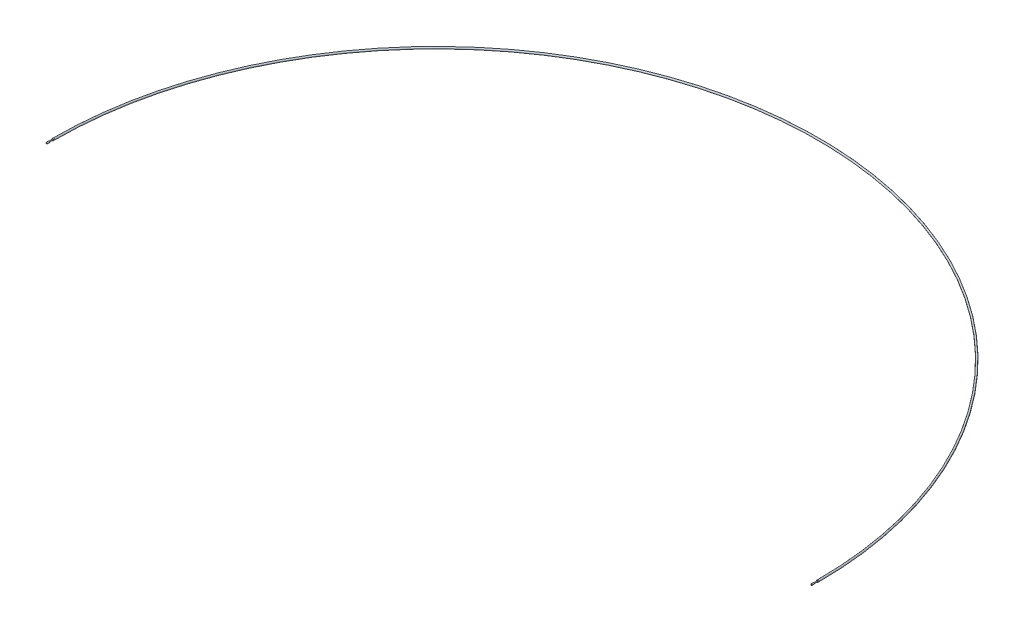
ISO-10303-21;
HEADER;
FILE_DESCRIPTION(('STEP AP214'),'2;1');
FILE_NAME('part.step','',(''),(''),'','','');
FILE_SCHEMA(('AUTOMOTIVE_DESIGN { 1 0 10303 214 1 1 1 1 }'));
ENDSEC;
DATA;
#1=APPLICATION_CONTEXT('core data for automotive mechanical design processes');
#2=APPLICATION_PROTOCOL_DEFINITION('international standard','automotive_design',2000,#1);
#3=PRODUCT_CONTEXT('',#1,'mechanical');
#4=PRODUCT('Part','Part','',(#3));
#5=PRODUCT_RELATED_PRODUCT_CATEGORY('part','',(#4));
#6=PRODUCT_DEFINITION_FORMATION('','',#4);
#7=PRODUCT_DEFINITION_CONTEXT('part definition',#1,'design');
#8=PRODUCT_DEFINITION('design','',#6,#7);
#9=PRODUCT_DEFINITION_SHAPE('','',#8);
#10=(LENGTH_UNIT() NAMED_UNIT(*) SI_UNIT(.MILLI.,.METRE.));
#11=(NAMED_UNIT(*) PLANE_ANGLE_UNIT() SI_UNIT($,.RADIAN.));
#12=(NAMED_UNIT(*) SI_UNIT($,.STERADIAN.) SOLID_ANGLE_UNIT());
#13=UNCERTAINTY_MEASURE_WITH_UNIT(LENGTH_MEASURE(1.E-05),#10,'distance_accuracy_value','');
#14=(GEOMETRIC_REPRESENTATION_CONTEXT(3) GLOBAL_UNCERTAINTY_ASSIGNED_CONTEXT((#13)) GLOBAL_UNIT_ASSIGNED_CONTEXT((#10,
#11,#12)) REPRESENTATION_CONTEXT('',''));
#15=CARTESIAN_POINT('',(0.,0.,0.));
#16=DIRECTION('',(0.,0.,1.));
#17=DIRECTION('',(1.,0.,0.));
#18=AXIS2_PLACEMENT_3D('',#15,#16,#17);
#19=CARTESIAN_POINT('',(1358.29194632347,0.,2.02749093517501E-13));
#20=DIRECTION('',(0.,-1.,0.));
#21=DIRECTION('',(0.,0.,-1.));
#22=AXIS2_PLACEMENT_3D('',#19,#20,#21);
#23=TOROIDAL_SURFACE('',#22,1358.29194632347,3.175);
#24=CARTESIAN_POINT('',(0.,0.,0.));
#25=DIRECTION('',(0.,0.,1.));
#26=DIRECTION('',(1.,0.,0.));
#27=AXIS2_PLACEMENT_3D('',#24,#25,#26);
#28=CIRCLE('',#27,3.175);
#29=CARTESIAN_POINT('',(-3.17499999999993,0.,0.));
#30=VERTEX_POINT('',#29);
#31=EDGE_CURVE('E66',#30,#30,#28,.T.);
#32=CARTESIAN_POINT('',(2716.58389264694,0.,5.71840975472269E-13));
#33=DIRECTION('',(0.,0.,-1.));
#34=DIRECTION('',(-1.,0.,0.));
#35=AXIS2_PLACEMENT_3D('',#32,#33,#34);
#36=CIRCLE('',#35,3.175);
#37=CARTESIAN_POINT('',(2719.75889264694,0.,5.72703725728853E-13));
#38=VERTEX_POINT('',#37);
#39=EDGE_CURVE('E69',#38,#38,#36,.T.);
#40=CARTESIAN_POINT('',(1358.29194632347,0.,2.02749093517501E-13));
#41=DIRECTION('',(0.,-1.,0.));
#42=DIRECTION('',(0.,0.,-1.));
#43=AXIS2_PLACEMENT_3D('',#40,#41,#42);
#44=CIRCLE('',#43,1361.46694632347);
#45=EDGE_CURVE('',#30,#38,#44,.T.);
#46=ORIENTED_EDGE('',*,*,#31,.F.);
#47=ORIENTED_EDGE('',*,*,#39,.T.);
#48=ORIENTED_EDGE('',*,*,#45,.T.);
#49=ORIENTED_EDGE('',*,*,#45,.F.);
#50=EDGE_LOOP('',(#46,#48,#47,#49));
#51=FACE_BOUND('',#50,.T.);
#52=ADVANCED_FACE('F32',(#51),#23,.T.);
#53=CARTESIAN_POINT('',(0.,0.,3.81));
#54=DIRECTION('',(0.,0.,-1.));
#55=DIRECTION('',(-1.,0.,0.));
#56=AXIS2_PLACEMENT_3D('',#53,#54,#55);
#57=CYLINDRICAL_SURFACE('',#56,3.175);
#58=CARTESIAN_POINT('',(0.,0.,3.81));
#59=DIRECTION('',(0.,0.,1.));
#60=DIRECTION('',(1.,0.,0.));
#61=AXIS2_PLACEMENT_3D('',#58,#59,#60);
#62=CIRCLE('',#61,3.175);
#63=CARTESIAN_POINT('',(-3.175,0.,3.81));
#64=VERTEX_POINT('',#63);
#65=EDGE_CURVE('E70',#64,#64,#62,.T.);
#66=CARTESIAN_POINT('',(-3.175,0.,3.81));
#67=CARTESIAN_POINT('',(-3.175,0.,3.7703125));
#68=CARTESIAN_POINT('',(-3.175,0.,3.730625));
#69=CARTESIAN_POINT('',(-3.175,0.,3.65125));
#70=CARTESIAN_POINT('',(-3.175,0.,3.6115625));
#71=CARTESIAN_POINT('',(-3.175,0.,3.5321875));
#72=CARTESIAN_POINT('',(-3.175,0.,3.4925));
#73=CARTESIAN_POINT('',(-3.175,0.,3.413125));
#74=CARTESIAN_POINT('',(-3.175,0.,3.3734375));
#75=CARTESIAN_POINT('',(-3.175,0.,3.2940625));
#76=CARTESIAN_POINT('',(-3.175,0.,3.254375));
#77=CARTESIAN_POINT('',(-3.175,0.,3.175));
#78=CARTESIAN_POINT('',(-3.175,0.,3.1353125));
#79=CARTESIAN_POINT('',(-3.175,0.,3.0559375));
#80=CARTESIAN_POINT('',(-3.175,0.,3.01625));
#81=CARTESIAN_POINT('',(-3.175,0.,2.936875));
#82=CARTESIAN_POINT('',(-3.175,0.,2.8971875));
#83=CARTESIAN_POINT('',(-3.175,0.,2.8178125));
#84=CARTESIAN_POINT('',(-3.175,0.,2.778125));
#85=CARTESIAN_POINT('',(-3.175,0.,2.69875));
#86=CARTESIAN_POINT('',(-3.175,0.,2.6590625));
#87=CARTESIAN_POINT('',(-3.175,0.,2.5796875));
#88=CARTESIAN_POINT('',(-3.175,0.,2.54));
#89=CARTESIAN_POINT('',(-3.175,0.,2.460625));
#90=CARTESIAN_POINT('',(-3.175,0.,2.4209375));
#91=CARTESIAN_POINT('',(-3.175,0.,2.3415625));
#92=CARTESIAN_POINT('',(-3.175,0.,2.301875));
#93=CARTESIAN_POINT('',(-3.175,0.,2.2225));
#94=CARTESIAN_POINT('',(-3.175,0.,2.1828125));
#95=CARTESIAN_POINT('',(-3.175,0.,2.1034375));
#96=CARTESIAN_POINT('',(-3.175,0.,2.06375));
#97=CARTESIAN_POINT('',(-3.175,0.,1.984375));
#98=CARTESIAN_POINT('',(-3.175,0.,1.9446875));
#99=CARTESIAN_POINT('',(-3.175,0.,1.8653125));
#100=CARTESIAN_POINT('',(-3.175,0.,1.825625));
#101=CARTESIAN_POINT('',(-3.175,0.,1.74625));
#102=CARTESIAN_POINT('',(-3.175,0.,1.7065625));
#103=CARTESIAN_POINT('',(-3.175,0.,1.6271875));
#104=CARTESIAN_POINT('',(-3.175,0.,1.5875));
#105=CARTESIAN_POINT('',(-3.175,0.,1.508125));
#106=CARTESIAN_POINT('',(-3.175,0.,1.4684375));
#107=CARTESIAN_POINT('',(-3.175,0.,1.3890625));
#108=CARTESIAN_POINT('',(-3.175,0.,1.349375));
#109=CARTESIAN_POINT('',(-3.175,0.,1.27));
#110=CARTESIAN_POINT('',(-3.175,0.,1.2303125));
#111=CARTESIAN_POINT('',(-3.175,0.,1.1509375));
#112=CARTESIAN_POINT('',(-3.175,0.,1.11125));
#113=CARTESIAN_POINT('',(-3.175,0.,1.031875));
#114=CARTESIAN_POINT('',(-3.175,0.,0.9921875));
#115=CARTESIAN_POINT('',(-3.175,0.,0.9128125));
#116=CARTESIAN_POINT('',(-3.175,0.,0.873125));
#117=CARTESIAN_POINT('',(-3.175,0.,0.79375));
#118=CARTESIAN_POINT('',(-3.175,0.,0.7540625));
#119=CARTESIAN_POINT('',(-3.175,0.,0.6746875));
#120=CARTESIAN_POINT('',(-3.175,0.,0.635));
#121=CARTESIAN_POINT('',(-3.175,0.,0.555625));
#122=CARTESIAN_POINT('',(-3.175,0.,0.5159375));
#123=CARTESIAN_POINT('',(-3.175,0.,0.4365625));
#124=CARTESIAN_POINT('',(-3.175,0.,0.396875));
#125=CARTESIAN_POINT('',(-3.175,0.,0.3175));
#126=CARTESIAN_POINT('',(-3.175,0.,0.2778125));
#127=CARTESIAN_POINT('',(-3.175,0.,0.1984375));
#128=CARTESIAN_POINT('',(-3.175,0.,0.15875));
#129=CARTESIAN_POINT('',(-3.175,0.,0.0793749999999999));
#130=CARTESIAN_POINT('',(-3.175,0.,0.0396874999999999));
#131=CARTESIAN_POINT('',(-3.175,0.,0.));
#132=B_SPLINE_CURVE_WITH_KNOTS('',3,(#66,#67,#68,#69,#70,#71,#72,#73,#74,#75,#76,#77,#78,#79,
#80,#81,#82,#83,#84,#85,#86,#87,#88,#89,#90,#91,#92,#93,#94,#95,#96,#97,#98,#99,#100,#101,#102,
#103,#104,#105,#106,#107,#108,#109,#110,#111,#112,#113,#114,#115,#116,#117,#118,#119,#120,#121,
#122,#123,#124,#125,#126,#127,#128,#129,#130,#131),.UNSPECIFIED.,.F.,.F.,(4,2,2,2,2,2,2,2,2,2,2,
2,2,2,2,2,2,2,2,2,2,2,2,2,2,2,2,2,2,2,2,2,4),(0.,0.1190625,0.238125,0.3571875,0.47625,
0.595312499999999,0.714375,0.833437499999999,0.952499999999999,1.0715625,1.190625,1.3096875,
1.42875,1.5478125,1.666875,1.7859375,1.905,2.0240625,2.143125,2.2621875,2.38125,2.5003125,
2.619375,2.7384375,2.8575,2.9765625,3.095625,3.2146875,3.33375,3.4528125,3.571875,3.6909375,
3.81),.UNSPECIFIED.);
#133=EDGE_CURVE('BSEAM120',#64,#30,#132,.T.);
#134=ORIENTED_EDGE('',*,*,#65,.F.);
#135=ORIENTED_EDGE('',*,*,#31,.T.);
#136=ORIENTED_EDGE('',*,*,#133,.T.);
#137=ORIENTED_EDGE('',*,*,#133,.F.);
#138=EDGE_LOOP('',(#134,#136,#135,#137));
#139=FACE_BOUND('',#138,.T.);
#140=ADVANCED_FACE('F120',(#139),#57,.T.);
#141=CARTESIAN_POINT('',(0.,0.,3.81));
#142=DIRECTION('',(0.,0.,1.));
#143=DIRECTION('',(1.,0.,0.));
#144=AXIS2_PLACEMENT_3D('',#141,#142,#143);
#145=PLANE('',#144);
#146=CARTESIAN_POINT('',(0.,0.,3.81));
#147=DIRECTION('',(0.,0.,1.));
#148=DIRECTION('',(1.,0.,0.));
#149=AXIS2_PLACEMENT_3D('',#146,#147,#148);
#150=CIRCLE('',#149,1.5875);
#151=CARTESIAN_POINT('',(1.5875,0.,3.81));
#152=VERTEX_POINT('',#151);
#153=EDGE_CURVE('E76',#152,#152,#150,.T.);
#154=ORIENTED_EDGE('',*,*,#153,.F.);
#155=EDGE_LOOP('',(#154));
#156=FACE_BOUND('',#155,.T.);
#157=ORIENTED_EDGE('',*,*,#65,.T.);
#158=EDGE_LOOP('',(#157));
#159=FACE_BOUND('',#158,.T.);
#160=ADVANCED_FACE('F125',(#156,#159),#145,.T.);
#161=CARTESIAN_POINT('',(0.,0.,16.51));
#162=DIRECTION('',(0.,0.,-1.));
#163=DIRECTION('',(-1.,0.,0.));
#164=AXIS2_PLACEMENT_3D('',#161,#162,#163);
#165=CYLINDRICAL_SURFACE('',#164,1.5875);
#166=CARTESIAN_POINT('',(0.,0.,16.51));
#167=DIRECTION('',(0.,0.,1.));
#168=DIRECTION('',(1.,0.,0.));
#169=AXIS2_PLACEMENT_3D('',#166,#167,#168);
#170=CIRCLE('',#169,1.5875);
#171=CARTESIAN_POINT('',(1.5875,0.,16.51));
#172=VERTEX_POINT('',#171);
#173=EDGE_CURVE('E79',#172,#172,#170,.T.);
#174=ORIENTED_EDGE('',*,*,#173,.F.);
#175=EDGE_LOOP('',(#174));
#176=FACE_BOUND('',#175,.T.);
#177=ORIENTED_EDGE('',*,*,#153,.T.);
#178=EDGE_LOOP('',(#177));
#179=FACE_BOUND('',#178,.T.);
#180=ADVANCED_FACE('F131',(#176,#179),#165,.T.);
#181=CARTESIAN_POINT('',(0.,0.,25.4));
#182=DIRECTION('',(0.,0.,-1.));
#183=DIRECTION('',(-1.,0.,0.));
#184=AXIS2_PLACEMENT_3D('',#181,#182,#183);
#185=CYLINDRICAL_SURFACE('',#184,2.38125);
#186=CARTESIAN_POINT('',(0.,0.,17.1449999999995));
#187=DIRECTION('',(0.,0.,1.));
#188=DIRECTION('',(1.,0.,0.));
#189=AXIS2_PLACEMENT_3D('',#186,#187,#188);
#190=CIRCLE('',#189,2.38125);
#191=CARTESIAN_POINT('',(2.38125,0.,17.1449999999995));
#192=VERTEX_POINT('',#191);
#193=EDGE_CURVE('E59',#192,#192,#190,.T.);
#194=ORIENTED_EDGE('',*,*,#193,.T.);
#195=EDGE_LOOP('',(#194));
#196=FACE_BOUND('',#195,.T.);
#197=CARTESIAN_POINT('',(0.,0.,24.7650000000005));
#198=DIRECTION('',(0.,0.,1.));
#199=DIRECTION('',(1.,0.,0.));
#200=AXIS2_PLACEMENT_3D('',#197,#198,#199);
#201=CIRCLE('',#200,2.38125);
#202=CARTESIAN_POINT('',(2.38125,0.,24.7650000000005));
#203=VERTEX_POINT('',#202);
#204=EDGE_CURVE('E62',#203,#203,#201,.F.);
#205=ORIENTED_EDGE('',*,*,#204,.T.);
#206=EDGE_LOOP('',(#205));
#207=FACE_BOUND('',#206,.T.);
#208=ADVANCED_FACE('F179',(#196,#207),#185,.T.);
#209=CARTESIAN_POINT('',(0.,0.,25.4));
#210=DIRECTION('',(0.,0.,1.));
#211=DIRECTION('',(1.,0.,0.));
#212=AXIS2_PLACEMENT_3D('',#209,#210,#211);
#213=PLANE('',#212);
#214=CARTESIAN_POINT('',(0.,0.,25.4));
#215=DIRECTION('',(0.,0.,1.));
#216=DIRECTION('',(1.,0.,0.));
#217=AXIS2_PLACEMENT_3D('',#214,#215,#216);
#218=CIRCLE('',#217,1.7462500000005);
#219=CARTESIAN_POINT('',(1.7462500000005,0.,25.4));
#220=VERTEX_POINT('',#219);
#221=EDGE_CURVE('E53',#220,#220,#218,.T.);
#222=ORIENTED_EDGE('',*,*,#221,.T.);
#223=EDGE_LOOP('',(#222));
#224=FACE_BOUND('',#223,.T.);
#225=ADVANCED_FACE('F176',(#224),#213,.T.);
#226=CARTESIAN_POINT('',(0.,0.,16.51));
#227=DIRECTION('',(0.,0.,1.));
#228=DIRECTION('',(1.,0.,0.));
#229=AXIS2_PLACEMENT_3D('',#226,#227,#228);
#230=PLANE('',#229);
#231=CARTESIAN_POINT('',(0.,0.,16.51));
#232=DIRECTION('',(0.,0.,1.));
#233=DIRECTION('',(1.,0.,0.));
#234=AXIS2_PLACEMENT_3D('',#231,#232,#233);
#235=CIRCLE('',#234,1.74625000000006);
#236=CARTESIAN_POINT('',(1.74625000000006,0.,16.51));
#237=VERTEX_POINT('',#236);
#238=EDGE_CURVE('E56',#237,#237,#235,.F.);
#239=ORIENTED_EDGE('',*,*,#238,.T.);
#240=EDGE_LOOP('',(#239));
#241=FACE_BOUND('',#240,.T.);
#242=ORIENTED_EDGE('',*,*,#173,.T.);
#243=EDGE_LOOP('',(#242));
#244=FACE_BOUND('',#243,.T.);
#245=ADVANCED_FACE('F114',(#241,#244),#230,.F.);
#246=CARTESIAN_POINT('',(2716.58389264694,0.,3.81));
#247=DIRECTION('',(0.,0.,-1.));
#248=DIRECTION('',(-1.,0.,0.));
#249=AXIS2_PLACEMENT_3D('',#246,#247,#248);
#250=CYLINDRICAL_SURFACE('',#249,3.17500000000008);
#251=CARTESIAN_POINT('',(2716.58389264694,0.,3.81));
#252=DIRECTION('',(0.,0.,1.));
#253=DIRECTION('',(1.,0.,0.));
#254=AXIS2_PLACEMENT_3D('',#251,#252,#253);
#255=CIRCLE('',#254,3.17500000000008);
#256=CARTESIAN_POINT('',(2719.75889264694,0.,3.81));
#257=VERTEX_POINT('',#256);
#258=EDGE_CURVE('E87',#257,#257,#255,.T.);
#259=ORIENTED_EDGE('',*,*,#258,.F.);
#260=EDGE_LOOP('',(#259));
#261=FACE_BOUND('',#260,.T.);
#262=ORIENTED_EDGE('',*,*,#39,.F.);
#263=EDGE_LOOP('',(#262));
#264=FACE_BOUND('',#263,.T.);
#265=ADVANCED_FACE('F108',(#261,#264),#250,.T.);
#266=CARTESIAN_POINT('',(2716.58389264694,0.,3.81));
#267=DIRECTION('',(0.,0.,1.));
#268=DIRECTION('',(1.,0.,0.));
#269=AXIS2_PLACEMENT_3D('',#266,#267,#268);
#270=PLANE('',#269);
#271=CARTESIAN_POINT('',(2716.58389264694,0.,3.81));
#272=DIRECTION('',(0.,0.,1.));
#273=DIRECTION('',(1.,0.,0.));
#274=AXIS2_PLACEMENT_3D('',#271,#272,#273);
#275=CIRCLE('',#274,1.58750000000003);
#276=CARTESIAN_POINT('',(2718.17139264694,0.,3.81));
#277=VERTEX_POINT('',#276);
#278=EDGE_CURVE('E65',#277,#277,#275,.T.);
#279=ORIENTED_EDGE('',*,*,#278,.F.);
#280=EDGE_LOOP('',(#279));
#281=FACE_BOUND('',#280,.T.);
#282=ORIENTED_EDGE('',*,*,#258,.T.);
#283=EDGE_LOOP('',(#282));
#284=FACE_BOUND('',#283,.T.);
#285=ADVANCED_FACE('F102',(#281,#284),#270,.T.);
#286=CARTESIAN_POINT('',(2716.58389264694,0.,16.51));
#287=DIRECTION('',(0.,0.,-1.));
#288=DIRECTION('',(-1.,0.,0.));
#289=AXIS2_PLACEMENT_3D('',#286,#287,#288);
#290=CYLINDRICAL_SURFACE('',#289,1.58750000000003);
#291=CARTESIAN_POINT('',(2716.58389264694,0.,16.51));
#292=DIRECTION('',(0.,0.,1.));
#293=DIRECTION('',(1.,0.,0.));
#294=AXIS2_PLACEMENT_3D('',#291,#292,#293);
#295=CIRCLE('',#294,1.58750000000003);
#296=CARTESIAN_POINT('',(2718.17139264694,0.,16.51));
#297=VERTEX_POINT('',#296);
#298=EDGE_CURVE('E90',#297,#297,#295,.T.);
#299=ORIENTED_EDGE('',*,*,#298,.F.);
#300=EDGE_LOOP('',(#299));
#301=FACE_BOUND('',#300,.T.);
#302=ORIENTED_EDGE('',*,*,#278,.T.);
#303=EDGE_LOOP('',(#302));
#304=FACE_BOUND('',#303,.T.);
#305=ADVANCED_FACE('F98',(#301,#304),#290,.T.);
#306=CARTESIAN_POINT('',(2716.58389264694,0.,25.4));
#307=DIRECTION('',(0.,0.,-1.));
#308=DIRECTION('',(-1.,0.,0.));
#309=AXIS2_PLACEMENT_3D('',#306,#307,#308);
#310=CYLINDRICAL_SURFACE('',#309,2.38124999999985);
#311=CARTESIAN_POINT('',(2716.58389264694,0.,17.1449999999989));
#312=DIRECTION('',(0.,0.,1.));
#313=DIRECTION('',(1.,0.,0.));
#314=AXIS2_PLACEMENT_3D('',#311,#312,#313);
#315=CIRCLE('',#314,2.38124999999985);
#316=CARTESIAN_POINT('',(2718.96514264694,0.,17.1449999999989));
#317=VERTEX_POINT('',#316);
#318=EDGE_CURVE('E44',#317,#317,#315,.T.);
#319=ORIENTED_EDGE('',*,*,#318,.T.);
#320=EDGE_LOOP('',(#319));
#321=FACE_BOUND('',#320,.T.);
#322=CARTESIAN_POINT('',(2716.58389264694,0.,24.7650000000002));
#323=DIRECTION('',(0.,0.,1.));
#324=DIRECTION('',(1.,0.,0.));
#325=AXIS2_PLACEMENT_3D('',#322,#323,#324);
#326=CIRCLE('',#325,2.38124999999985);
#327=CARTESIAN_POINT('',(2718.96514264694,0.,24.7650000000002));
#328=VERTEX_POINT('',#327);
#329=EDGE_CURVE('E48',#328,#328,#326,.F.);
#330=ORIENTED_EDGE('',*,*,#329,.T.);
#331=EDGE_LOOP('',(#330));
#332=FACE_BOUND('',#331,.T.);
#333=ADVANCED_FACE('F101',(#321,#332),#310,.T.);
#334=CARTESIAN_POINT('',(2716.58389264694,0.,25.4));
#335=DIRECTION('',(0.,0.,1.));
#336=DIRECTION('',(1.,0.,0.));
#337=AXIS2_PLACEMENT_3D('',#334,#335,#336);
#338=PLANE('',#337);
#339=CARTESIAN_POINT('',(2716.58389264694,0.,25.4));
#340=DIRECTION('',(0.,0.,1.));
#341=DIRECTION('',(1.,0.,0.));
#342=AXIS2_PLACEMENT_3D('',#339,#340,#341);
#343=CIRCLE('',#342,1.74624999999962);
#344=CARTESIAN_POINT('',(2718.33014264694,0.,25.4));
#345=VERTEX_POINT('',#344);
#346=EDGE_CURVE('E10',#345,#345,#343,.T.);
#347=ORIENTED_EDGE('',*,*,#346,.T.);
#348=EDGE_LOOP('',(#347));
#349=FACE_BOUND('',#348,.T.);
#350=ADVANCED_FACE('F163',(#349),#338,.T.);
#351=CARTESIAN_POINT('',(2716.58389264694,0.,16.51));
#352=DIRECTION('',(0.,0.,1.));
#353=DIRECTION('',(1.,0.,0.));
#354=AXIS2_PLACEMENT_3D('',#351,#352,#353);
#355=PLANE('',#354);
#356=CARTESIAN_POINT('',(2716.58389264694,0.,16.51));
#357=DIRECTION('',(0.,0.,1.));
#358=DIRECTION('',(1.,0.,0.));
#359=AXIS2_PLACEMENT_3D('',#356,#357,#358);
#360=CIRCLE('',#359,1.74625000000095);
#361=CARTESIAN_POINT('',(2718.33014264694,0.,16.51));
#362=VERTEX_POINT('',#361);
#363=EDGE_CURVE('E40',#362,#362,#360,.F.);
#364=ORIENTED_EDGE('',*,*,#363,.T.);
#365=EDGE_LOOP('',(#364));
#366=FACE_BOUND('',#365,.T.);
#367=ORIENTED_EDGE('',*,*,#298,.T.);
#368=EDGE_LOOP('',(#367));
#369=FACE_BOUND('',#368,.T.);
#370=ADVANCED_FACE('F96',(#366,#369),#355,.F.);
#371=CARTESIAN_POINT('',(0.,0.,17.1449999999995));
#372=DIRECTION('',(0.,0.,1.));
#373=DIRECTION('',(1.,0.,0.));
#374=AXIS2_PLACEMENT_3D('',#371,#372,#373);
#375=CONICAL_SURFACE('',#374,2.38125,0.785398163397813);
#376=ORIENTED_EDGE('',*,*,#238,.F.);
#377=EDGE_LOOP('',(#376));
#378=FACE_BOUND('',#377,.T.);
#379=ORIENTED_EDGE('',*,*,#193,.F.);
#380=EDGE_LOOP('',(#379));
#381=FACE_BOUND('',#380,.T.);
#382=ADVANCED_FACE('F144',(#378,#381),#375,.T.);
#383=CARTESIAN_POINT('',(0.,0.,25.4));
#384=DIRECTION('',(0.,0.,-1.));
#385=DIRECTION('',(-1.,0.,0.));
#386=AXIS2_PLACEMENT_3D('',#383,#384,#385);
#387=CONICAL_SURFACE('',#386,1.7462500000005,0.785398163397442);
#388=ORIENTED_EDGE('',*,*,#204,.F.);
#389=EDGE_LOOP('',(#388));
#390=FACE_BOUND('',#389,.T.);
#391=ORIENTED_EDGE('',*,*,#221,.F.);
#392=EDGE_LOOP('',(#391));
#393=FACE_BOUND('',#392,.T.);
#394=ADVANCED_FACE('F147',(#390,#393),#387,.T.);
#395=CARTESIAN_POINT('',(2716.58389264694,0.,17.1449999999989));
#396=DIRECTION('',(0.,0.,1.));
#397=DIRECTION('',(1.,0.,0.));
#398=AXIS2_PLACEMENT_3D('',#395,#396,#397);
#399=CONICAL_SURFACE('',#398,2.38124999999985,0.785398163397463);
#400=ORIENTED_EDGE('',*,*,#363,.F.);
#401=EDGE_LOOP('',(#400));
#402=FACE_BOUND('',#401,.T.);
#403=ORIENTED_EDGE('',*,*,#318,.F.);
#404=EDGE_LOOP('',(#403));
#405=FACE_BOUND('',#404,.T.);
#406=ADVANCED_FACE('F150',(#402,#405),#399,.T.);
#407=CARTESIAN_POINT('',(2716.58389264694,0.,25.4));
#408=DIRECTION('',(0.,0.,-1.));
#409=DIRECTION('',(-1.,0.,0.));
#410=AXIS2_PLACEMENT_3D('',#407,#408,#409);
#411=CONICAL_SURFACE('',#410,1.74624999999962,0.785398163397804);
#412=ORIENTED_EDGE('',*,*,#329,.F.);
#413=EDGE_LOOP('',(#412));
#414=FACE_BOUND('',#413,.T.);
#415=ORIENTED_EDGE('',*,*,#346,.F.);
#416=EDGE_LOOP('',(#415));
#417=FACE_BOUND('',#416,.T.);
#418=ADVANCED_FACE('F34',(#414,#417),#411,.T.);
#419=CLOSED_SHELL('',(#52,#140,#160,#180,#208,#225,#245,#265,#285,#305,#333,#350,#370,#382,#394,
#406,#418));
#420=CARTESIAN_POINT('',(0.,0.,0.));
#421=DIRECTION('',(0.,0.,1.));
#422=DIRECTION('',(1.,0.,0.));
#423=AXIS2_PLACEMENT_3D('',#420,#421,#422);
#424=PLANE('',#423);
#425=CARTESIAN_POINT('',(0.,0.,0.));
#426=DIRECTION('',(0.,0.,1.));
#427=DIRECTION('',(1.,0.,0.));
#428=AXIS2_PLACEMENT_3D('',#425,#426,#427);
#429=CIRCLE('',#428,2.38125);
#430=CARTESIAN_POINT('',(-2.38125,0.,0.));
#431=VERTEX_POINT('',#430);
#432=EDGE_CURVE('E73',#431,#431,#429,.F.);
#433=ORIENTED_EDGE('',*,*,#432,.T.);
#434=EDGE_LOOP('',(#433));
#435=FACE_BOUND('',#434,.T.);
#436=ADVANCED_FACE('F137',(#435),#424,.F.);
#437=CARTESIAN_POINT('',(1358.29194632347,0.,2.02749093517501E-13));
#438=DIRECTION('',(0.,-1.,0.));
#439=DIRECTION('',(0.,0.,-1.));
#440=AXIS2_PLACEMENT_3D('',#437,#438,#439);
#441=TOROIDAL_SURFACE('',#440,1358.29194632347,2.38125);
#442=CARTESIAN_POINT('',(2716.58389264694,0.,2.02749093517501E-13));
#443=DIRECTION('',(0.,0.,1.));
#444=DIRECTION('',(1.,0.,0.));
#445=AXIS2_PLACEMENT_3D('',#442,#443,#444);
#446=CIRCLE('',#445,2.38125);
#447=CARTESIAN_POINT('',(2718.96514264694,0.,2.02749093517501E-13));
#448=VERTEX_POINT('',#447);
#449=EDGE_CURVE('E84',#448,#448,#446,.F.);
#450=CARTESIAN_POINT('',(1358.29194632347,0.,2.02749093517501E-13));
#451=DIRECTION('',(0.,-1.,0.));
#452=DIRECTION('',(0.,0.,-1.));
#453=AXIS2_PLACEMENT_3D('',#450,#451,#452);
#454=CIRCLE('',#453,1360.67319632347);
#455=EDGE_CURVE('',#431,#448,#454,.T.);
#456=ORIENTED_EDGE('',*,*,#432,.F.);
#457=ORIENTED_EDGE('',*,*,#449,.F.);
#458=ORIENTED_EDGE('',*,*,#455,.T.);
#459=ORIENTED_EDGE('',*,*,#455,.F.);
#460=EDGE_LOOP('',(#456,#458,#457,#459));
#461=FACE_BOUND('',#460,.T.);
#462=ADVANCED_FACE('F138',(#461),#441,.F.);
#463=CARTESIAN_POINT('',(2716.58389264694,0.,0.));
#464=DIRECTION('',(0.,0.,1.));
#465=DIRECTION('',(1.,0.,0.));
#466=AXIS2_PLACEMENT_3D('',#463,#464,#465);
#467=PLANE('',#466);
#468=ORIENTED_EDGE('',*,*,#449,.T.);
#469=EDGE_LOOP('',(#468));
#470=FACE_BOUND('',#469,.T.);
#471=ADVANCED_FACE('F140',(#470),#467,.F.);
#472=CLOSED_SHELL('',(#436,#462,#471));
#473=ORIENTED_CLOSED_SHELL('',*,#472,.T.);
#474=BREP_WITH_VOIDS('B2',#419,(#473));
#475=ADVANCED_BREP_SHAPE_REPRESENTATION('',(#18,#474),#14);
#476=SHAPE_DEFINITION_REPRESENTATION(#9,#475);
ENDSEC;
END-ISO-10303-21;
